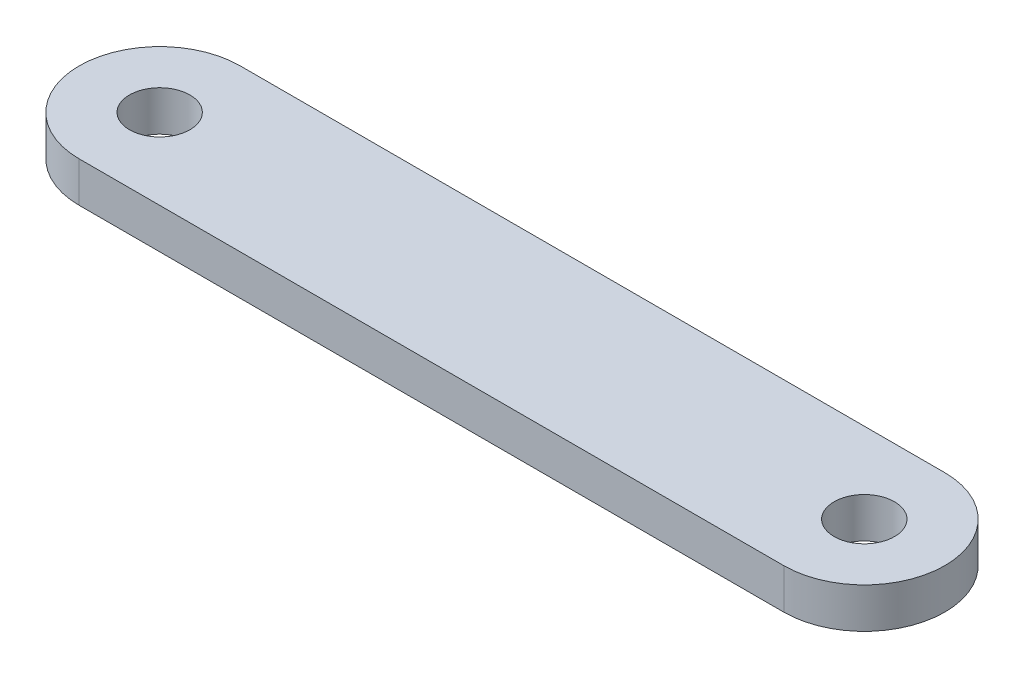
from build123d import *

# Parameters (mm, degrees)
SKETCH_1_R      = 1.5
EXTRUDE_1_DEPTH = 2


with BuildPart() as part:
    # Sketch 1 → Extrude 1 (new body)
    with BuildSketch(Plane(origin=(0, 0, 0), x_dir=(1, 0, 0), z_dir=(0, 1, 0))):
        with BuildLine():
            Line((0, 4), (35, 4))
            ThreePointArc((35, 4), (39, 0), (35, -4))
            Line((35, -4), (0, -4))
            ThreePointArc((0, -4), (-4, 0), (0, 4))
        make_face()
        with Locations(Location((0, 0, 0), (0, 0, 270))):
            Circle(SKETCH_1_R, mode=Mode.SUBTRACT)
        with Locations(Location((35, 0, 0), (0, 0, 270))):
            Circle(SKETCH_1_R, mode=Mode.SUBTRACT)
    extrude(amount=EXTRUDE_1_DEPTH)


solid = part.part
